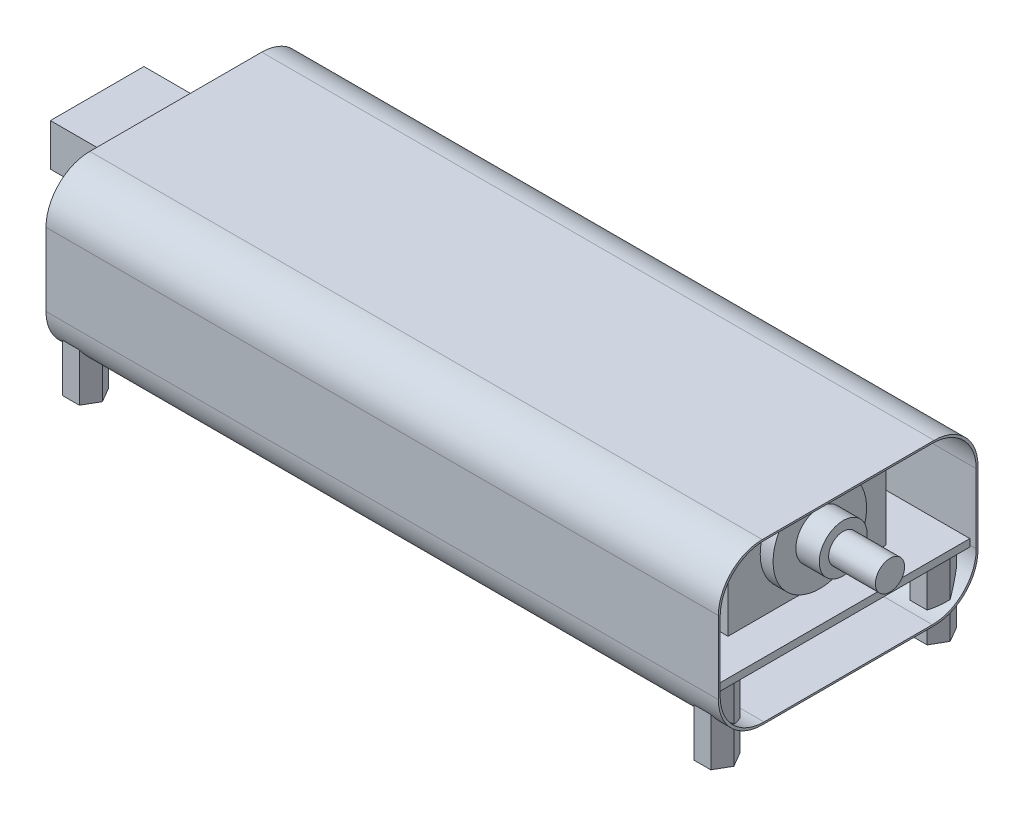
from build123d import *

# Parameters (mm, degrees)
SKETCH1_W            = 145.034
SKETCH1_H            = 54.991
BASE_EXTRUDE_DEPTH   = 1.6002
SKETCH2_W            = 87.884
SKETCH2_H            = 54.991
BOSS_EXTRUDE1_DEPTH  = 12.7
CONN_COMM_DEPTH      = 17.018
CONN_COMM_DEPTH_BACK = 6.35
SKETCH16_W           = 20.32
SKETCH16_H           = 9.144
SKETCH17_W           = 5.08
SKETCH17_H           = 10.16
CONN_PINS_DEPTH      = 16.51
SKETCH17_W_2         = 7.62
SKETCH17_H_2         = 2.54
CONN_PINS_2_DEPTH    = 16.51
SKETCH14_W           = 20.052826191
SKETCH14_H           = 12.7
COILS_DEPTH          = 9.525
SKETCH3_W            = 12.446
SKETCH3_H            = 34.29
BOSS_EXTRUDE2_DEPTH  = 22.606
SKETCH6_R            = 1.27
HEXSTNDOFF_DEPTH     = 15.875
SHIELD_DEPTH         = 146.05
CUT_EXTRUDE1_START   = -6.35
SKETCH18_R           = 1.27
CUT_EXTRUDE1_DEPTH   = 6.35


with BuildPart() as part:
    # Sketch1 → Base-Extrude (new body)
    with BuildSketch(Plane(origin=(0, 0, 0), x_dir=(1, 0, 0), z_dir=(0, 1, 0))):
        with Locations((72.517, 27.4955)):
            Rectangle(SKETCH1_W, SKETCH1_H)
    extrude(amount=BASE_EXTRUDE_DEPTH)

    # Sketch2 → Boss-Extrude1 (add)
    with BuildSketch(Plane(origin=(0, 1.6002, 0), x_dir=(-1, 0, 0), z_dir=(0, 1, 0))):
        with Locations((-43.942, -27.4955)):
            Rectangle(SKETCH2_W, SKETCH2_H)
    extrude(amount=BOSS_EXTRUDE1_DEPTH)

    # Sketch16 → Conn Comm (add, two sides: drawn at the far end of the back side and taken through both)
    with BuildSketch(Plane.ZY.offset(-CONN_COMM_DEPTH_BACK)):
        with Locations((-27.4955, 13.462)):
            Rectangle(SKETCH16_W, SKETCH16_H)
    extrude(amount=CONN_COMM_DEPTH + CONN_COMM_DEPTH_BACK)

    # Sketch14 → Coils (add)
    with BuildSketch(Plane.XZ):
        with Locations((67.762988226, -14.403423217)):
            Rectangle(SKETCH14_W, SKETCH14_H)
        with Locations((67.762988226, -38.458362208)):
            Rectangle(SKETCH14_W, SKETCH14_H)
    extrude(amount=COILS_DEPTH)

    # Sketch3 → Boss-Extrude2 (add)
    with BuildSketch(Plane(origin=(0, 1.6002, 0), x_dir=(-1, 0, 0), z_dir=(0, 1, 0))):
        with Locations((-130.937, -27.4955)):
            Rectangle(SKETCH3_W, SKETCH3_H)
    extrude(amount=BOSS_EXTRUDE2_DEPTH)

    # Sketch4 → Boss-Revolve1 (revolve)
    with BuildSketch(Plane(origin=(0, 13.5382, 0), x_dir=(-1, 0, 0), z_dir=(0, 1, 0)), mode=Mode.PRIVATE) as boss_revolve1_sk:
        Polygon((-155.194, -27.4955), (-155.194, -30.6705), (-145.034, -30.6705), (-145.034, -32.7025), (-139.954, -32.7025), (-139.954, -37.6555), (-137.16, -37.6555), (-137.16, -27.4955), align=None)
    revolve(boss_revolve1_sk.sketch.rotate(Axis((137.16, 13.5382, -27.4955), (1, 0, 0)), 180), axis=Axis((137.16, 13.5382, -27.4955), (1, 0, 0)))

    # Sketch5 → Boss-Revolve2 (revolve)
    with BuildSketch(Plane(origin=(0, 13.5382, 0), x_dir=(-1, 0, 0), z_dir=(0, 1, 0))):
        Polygon((-124.714, -27.4955), (-124.714, -36.3855), (-122.936, -36.3855), (-122.936, -38.6715), (-105.918, -38.6715), (-105.918, -31.9405), (-96.393, -31.9405), (-96.393, -27.4955), align=None)
    revolve(axis=Axis((124.714, 13.5382, -27.4955), (-1, 0, 0)))

    # Sketch6 → HexStndOff (add)
    # profile 1 of 4: a face of its own
    with BuildSketch(Plane.XZ):
        Polygon((139.263912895, -7.1755), (142.930087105, -7.1755), (144.763174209, -4.0005), (142.930087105, -0.8255), (139.263912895, -0.8255), (137.430825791, -4.0005), align=None)
        with Locations(Location((141.097, -4.0005, 0), (0, 0, 270))):
            Circle(SKETCH6_R, mode=Mode.SUBTRACT)
    # profile 2 of 4: a face of its own
    with BuildSketch(Plane.XZ):
        Polygon((137.430825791, -50.9905), (139.263912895, -54.1655), (142.930087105, -54.1655), (144.763174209, -50.9905), (142.930087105, -47.8155), (139.263912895, -47.8155), align=None)
        with Locations(Location((141.097, -50.9905, 0), (0, 0, 270))):
            Circle(SKETCH6_R, mode=Mode.SUBTRACT)
    # profile 3 of 4: a face of its own
    with BuildSketch(Plane.XZ):
        Polygon((2.103912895, -7.1755), (5.770087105, -7.1755), (7.603174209, -4.0005), (5.770087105, -0.8255), (2.103912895, -0.8255), (0.270825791, -4.0005), align=None)
        with Locations(Location((3.937, -4.0005, 0), (0, 0, 270))):
            Circle(SKETCH6_R, mode=Mode.SUBTRACT)
    # profile 4 of 4: a face of its own
    with BuildSketch(Plane.XZ):
        Polygon((0.270825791, -50.9905), (2.103912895, -54.1655), (5.770087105, -54.1655), (7.603174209, -50.9905), (5.770087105, -47.8155), (2.103912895, -47.8155), align=None)
        with Locations(Location((3.937, -50.9905, 0), (0, 0, 270))):
            Circle(SKETCH6_R, mode=Mode.SUBTRACT)
    extrude(amount=HEXSTNDOFF_DEPTH)



with BuildPart() as body_2:
    # Sketch17 → Conn Pins (new body)
    with BuildSketch(Plane(origin=(0, 1.6002, 0), x_dir=(-1, 0, 0), z_dir=(0, 1, 0))):
        with Locations((-5.08, -47.371)):
            Rectangle(SKETCH17_W, SKETCH17_H)
    extrude(amount=CONN_PINS_DEPTH)


with BuildPart() as body_3:
    # Sketch17 → Conn Pins 2 (new body)
    with BuildSketch(Plane(origin=(0, 1.6002, 0), x_dir=(-1, 0, 0), z_dir=(0, 1, 0))):
        with Locations((-36.83, -6.35)):
            Rectangle(SKETCH17_W_2, SKETCH17_H_2)
    extrude(amount=CONN_PINS_2_DEPTH)


with BuildPart() as part_1:
    add(part.part)

    add(body_3.part)  # Shield merges body 3

    add(body_2.part)  # Shield merges body 2
    # Sketch7 → Shield (add)
    with BuildSketch(Plane(origin=(0, 0, 0), x_dir=(0, 0, -1), z_dir=(1, 0, 0))):
        with BuildLine():
            Line((8.89, 24.9682), (46.228, 24.9682))
            ThreePointArc((46.228, 24.9682), (52.963192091, 22.178392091), (55.753, 15.4432))
            Line((55.753, 15.4432), (55.753, -0.381))
            ThreePointArc((55.753, -0.381), (52.963192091, -7.116192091), (46.228, -9.906))
            Line((46.228, -9.906), (8.89, -9.906))
            ThreePointArc((8.89, -9.906), (2.154807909, -7.116192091), (-0.635, -0.381))
            Line((-0.635, -0.381), (-0.635, 15.4432))
            ThreePointArc((-0.635, 15.4432), (2.154807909, 22.178392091), (8.89, 24.9682))
        make_face()
        with BuildLine():
            Line((9.271, 24.5872), (45.847, 24.5872))
            ThreePointArc((45.847, 24.5872), (52.582192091, 21.797392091), (55.372, 15.0622))
            Line((55.372, 15.0622), (55.372, 0))
            ThreePointArc((55.372, 0), (52.582192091, -6.735192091), (45.847, -9.525))
            Line((45.847, -9.525), (9.271, -9.525))
            ThreePointArc((9.271, -9.525), (2.535807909, -6.735192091), (-0.254, 0))
            Line((-0.254, 0), (-0.254, 15.0622))
            ThreePointArc((-0.254, 15.0622), (2.535807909, 21.797392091), (9.271, 24.5872))
        make_face(mode=Mode.SUBTRACT)
    extrude(amount=SHIELD_DEPTH)

    # Sketch18 → Cut-Extrude1 (cut)
    with BuildSketch(Plane.XZ.offset(9.906).offset(CUT_EXTRUDE1_START)):
        with Locations(Location((3.937, -50.9905, 0), (0, 0, 270))):
            Circle(SKETCH18_R)
        with Locations(Location((141.097, -50.9905, 0), (0, 0, 270))):
            Circle(SKETCH18_R)
        with Locations(Location((141.097, -4.0005, 0), (0, 0, 270))):
            Circle(SKETCH18_R)
        with Locations(Location((3.937, -4.0005, 0), (0, 0, 270))):
            Circle(SKETCH18_R)
    extrude(amount=CUT_EXTRUDE1_DEPTH, mode=Mode.SUBTRACT)


solid = part_1.part
